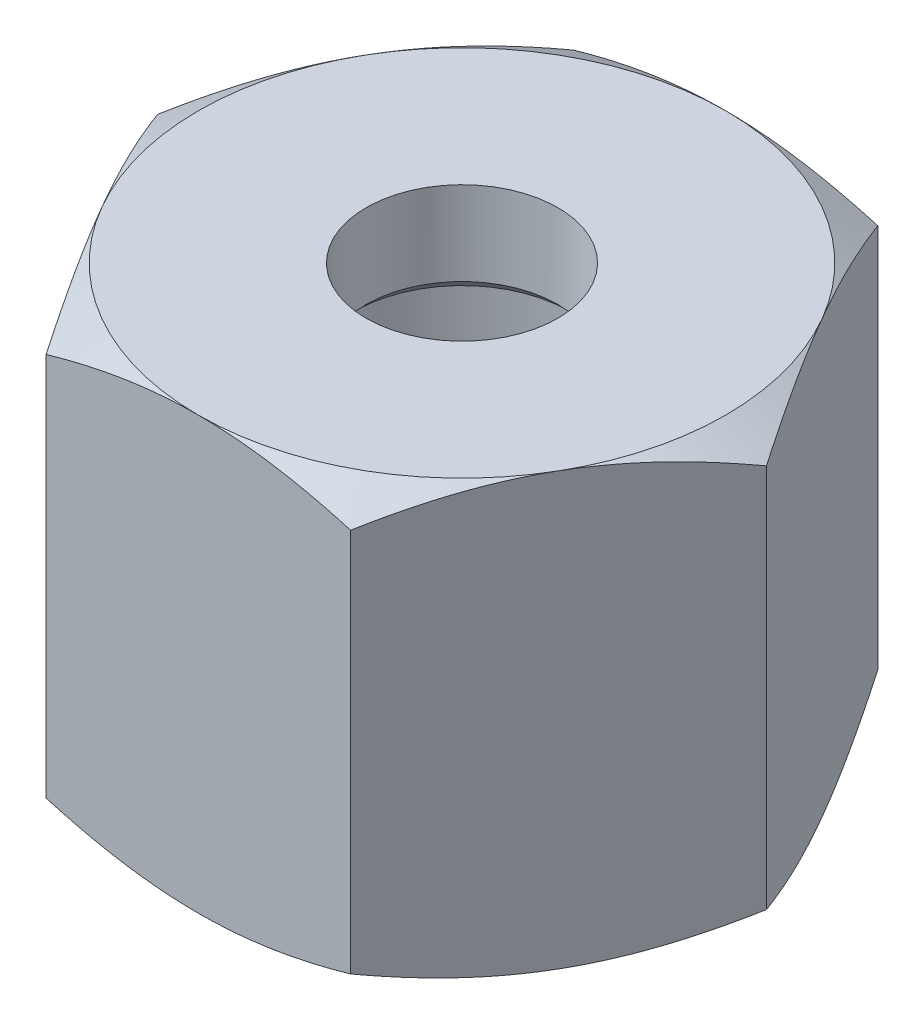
ISO-10303-21;
HEADER;
FILE_DESCRIPTION(('STEP AP214'),'2;1');
FILE_NAME('part.step','',(''),(''),'','','');
FILE_SCHEMA(('AUTOMOTIVE_DESIGN { 1 0 10303 214 1 1 1 1 }'));
ENDSEC;
DATA;
#1=APPLICATION_CONTEXT('core data for automotive mechanical design processes');
#2=APPLICATION_PROTOCOL_DEFINITION('international standard','automotive_design',2000,#1);
#3=PRODUCT_CONTEXT('',#1,'mechanical');
#4=PRODUCT('Part','Part','',(#3));
#5=PRODUCT_RELATED_PRODUCT_CATEGORY('part','',(#4));
#6=PRODUCT_DEFINITION_FORMATION('','',#4);
#7=PRODUCT_DEFINITION_CONTEXT('part definition',#1,'design');
#8=PRODUCT_DEFINITION('design','',#6,#7);
#9=PRODUCT_DEFINITION_SHAPE('','',#8);
#10=(LENGTH_UNIT() NAMED_UNIT(*) SI_UNIT(.MILLI.,.METRE.));
#11=(NAMED_UNIT(*) PLANE_ANGLE_UNIT() SI_UNIT($,.RADIAN.));
#12=(NAMED_UNIT(*) SI_UNIT($,.STERADIAN.) SOLID_ANGLE_UNIT());
#13=UNCERTAINTY_MEASURE_WITH_UNIT(LENGTH_MEASURE(1.E-05),#10,'distance_accuracy_value','');
#14=(GEOMETRIC_REPRESENTATION_CONTEXT(3) GLOBAL_UNCERTAINTY_ASSIGNED_CONTEXT((#13)) GLOBAL_UNIT_ASSIGNED_CONTEXT((#10,
#11,#12)) REPRESENTATION_CONTEXT('',''));
#15=CARTESIAN_POINT('',(0.,0.,0.));
#16=DIRECTION('',(0.,0.,1.));
#17=DIRECTION('',(1.,0.,0.));
#18=AXIS2_PLACEMENT_3D('',#15,#16,#17);
#19=CARTESIAN_POINT('',(6.35085296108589,18.,11.));
#20=DIRECTION('',(-0.866025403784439,0.,-0.5));
#21=DIRECTION('',(-0.5,0.,0.866025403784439));
#22=AXIS2_PLACEMENT_3D('',#19,#20,#21);
#23=PLANE('',#22);
#24=CARTESIAN_POINT('',(12.7018213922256,0.982547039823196,-0.000200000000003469));
#25=CARTESIAN_POINT('',(12.5622159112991,0.901959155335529,0.241603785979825));
#26=CARTESIAN_POINT('',(12.4220899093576,0.825028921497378,0.48430914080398));
#27=CARTESIAN_POINT('',(12.1407142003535,0.67949864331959,0.971666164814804));
#28=CARTESIAN_POINT('',(11.999464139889,0.610901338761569,1.21631844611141));
#29=CARTESIAN_POINT('',(11.5734380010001,0.418936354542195,1.9542173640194));
#30=CARTESIAN_POINT('',(11.2869801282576,0.309747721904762,2.45037695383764));
#31=CARTESIAN_POINT('',(10.8583090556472,0.181714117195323,3.19285703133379));
#32=CARTESIAN_POINT('',(10.7173765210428,0.145242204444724,3.43695934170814));
#33=CARTESIAN_POINT('',(10.4348589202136,0.0840813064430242,3.92629418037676));
#34=CARTESIAN_POINT('',(10.2932738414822,0.0593925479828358,4.17152673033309));
#35=CARTESIAN_POINT('',(10.0098676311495,0.0224303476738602,4.66240068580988));
#36=CARTESIAN_POINT('',(9.86804698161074,0.0101421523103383,4.90804125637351));
#37=CARTESIAN_POINT('',(9.58427426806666,-0.00175707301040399,5.39955001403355));
#38=CARTESIAN_POINT('',(9.44232220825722,-0.00136849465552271,5.64541819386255));
#39=CARTESIAN_POINT('',(9.17694200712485,0.0112011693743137,6.10507018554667));
#40=CARTESIAN_POINT('',(9.05349494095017,0.0218490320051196,6.31888677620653));
#41=CARTESIAN_POINT('',(8.80688473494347,0.0525316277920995,6.74602818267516));
#42=CARTESIAN_POINT('',(8.68372161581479,0.0725670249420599,6.9593529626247));
#43=CARTESIAN_POINT('',(8.43774623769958,0.12167538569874,7.38539481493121));
#44=CARTESIAN_POINT('',(8.31493435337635,0.150755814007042,7.59811123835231));
#45=CARTESIAN_POINT('',(8.0698863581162,0.217443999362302,8.02254681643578));
#46=CARTESIAN_POINT('',(7.94765028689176,0.255052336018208,8.23426590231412));
#47=CARTESIAN_POINT('',(7.5765957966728,0.38161991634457,8.87695113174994));
#48=CARTESIAN_POINT('',(7.32885191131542,0.483199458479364,9.30605612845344));
#49=CARTESIAN_POINT('',(6.83705838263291,0.713743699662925,10.1578675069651));
#50=CARTESIAN_POINT('',(6.59300244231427,0.842654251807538,10.580584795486));
#51=CARTESIAN_POINT('',(6.35073749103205,0.982547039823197,11.0002));
#52=B_SPLINE_CURVE_WITH_KNOTS('',3,(#24,#25,#26,#27,#28,#29,#30,#31,#32,#33,#34,#35,#36,#37,#38,
#39,#40,#41,#42,#43,#44,#45,#46,#47,#48,#49,#50,#51),.UNSPECIFIED.,.F.,.F.,(4,2,2,2,2,2,2,2,2,2,
2,2,2,4),(0.,0.871755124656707,1.74379610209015,3.49159027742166,4.34403665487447,
5.19649943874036,6.0479468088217,6.89936787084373,7.64056020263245,8.38180496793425,
9.12366309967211,9.86557166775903,11.3820155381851,12.8954827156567),.UNSPECIFIED.);
#53=CARTESIAN_POINT('',(12.7017059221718,0.982480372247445,0.));
#54=VERTEX_POINT('',#53);
#55=CARTESIAN_POINT('',(9.52627944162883,0.,5.5));
#56=VERTEX_POINT('',#55);
#57=EDGE_CURVE('E53',#54,#56,#52,.T.);
#58=ORIENTED_EDGE('',*,*,#57,.F.);
#59=DIRECTION('',(0.,-1.,0.));
#60=VECTOR('',#59,1.);
#61=CARTESIAN_POINT('',(12.7017059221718,18.,0.));
#62=LINE('',#61,#60);
#63=CARTESIAN_POINT('',(12.7017059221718,17.0175196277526,0.));
#64=VERTEX_POINT('',#63);
#65=EDGE_CURVE('E172',#64,#54,#62,.T.);
#66=ORIENTED_EDGE('',*,*,#65,.F.);
#67=CARTESIAN_POINT('',(6.35073749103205,17.0174529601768,11.0002));
#68=CARTESIAN_POINT('',(6.49034297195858,17.0980408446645,10.7583962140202));
#69=CARTESIAN_POINT('',(6.63046897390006,17.1749710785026,10.515690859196));
#70=CARTESIAN_POINT('',(6.91184468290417,17.3205013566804,10.0283338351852));
#71=CARTESIAN_POINT('',(7.05309474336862,17.3890986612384,9.78368155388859));
#72=CARTESIAN_POINT('',(7.47912088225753,17.5810636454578,9.04578263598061));
#73=CARTESIAN_POINT('',(7.76557875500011,17.6902522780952,8.54962304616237));
#74=CARTESIAN_POINT('',(8.19424982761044,17.8182858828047,7.80714296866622));
#75=CARTESIAN_POINT('',(8.33518236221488,17.8547577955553,7.56304065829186));
#76=CARTESIAN_POINT('',(8.61769996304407,17.915918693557,7.07370581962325));
#77=CARTESIAN_POINT('',(8.75928504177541,17.9406074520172,6.82847326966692));
#78=CARTESIAN_POINT('',(9.04269125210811,17.9775696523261,6.33759931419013));
#79=CARTESIAN_POINT('',(9.18451190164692,17.9898578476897,6.0919587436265));
#80=CARTESIAN_POINT('',(9.468284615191,18.0017570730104,5.60044998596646));
#81=CARTESIAN_POINT('',(9.61023667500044,18.0013684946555,5.35458180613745));
#82=CARTESIAN_POINT('',(9.87561687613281,17.9887988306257,4.89492981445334));
#83=CARTESIAN_POINT('',(9.99906394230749,17.9781509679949,4.68111322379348));
#84=CARTESIAN_POINT('',(10.2456741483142,17.9474683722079,4.25397181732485));
#85=CARTESIAN_POINT('',(10.3688372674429,17.9274329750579,4.04064703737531));
#86=CARTESIAN_POINT('',(10.6148126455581,17.8783246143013,3.6146051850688));
#87=CARTESIAN_POINT('',(10.7376245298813,17.849244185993,3.4018887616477));
#88=CARTESIAN_POINT('',(10.9826725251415,17.7825560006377,2.97745318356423));
#89=CARTESIAN_POINT('',(11.1049085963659,17.7449476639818,2.76573409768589));
#90=CARTESIAN_POINT('',(11.4759630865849,17.6183800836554,2.12304886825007));
#91=CARTESIAN_POINT('',(11.7237069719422,17.5168005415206,1.69394387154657));
#92=CARTESIAN_POINT('',(12.2155005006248,17.2862563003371,0.842132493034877));
#93=CARTESIAN_POINT('',(12.4595564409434,17.1573457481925,0.419415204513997));
#94=CARTESIAN_POINT('',(12.7018213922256,17.0174529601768,-0.000200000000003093));
#95=B_SPLINE_CURVE_WITH_KNOTS('',3,(#67,#68,#69,#70,#71,#72,#73,#74,#75,#76,#77,#78,#79,#80,#81,
#82,#83,#84,#85,#86,#87,#88,#89,#90,#91,#92,#93,#94),.UNSPECIFIED.,.F.,.F.,(4,2,2,2,2,2,2,2,2,2,
2,2,2,4),(0.,0.871755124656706,1.74379610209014,3.49159027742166,4.34403665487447,
5.19649943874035,6.0479468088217,6.89936787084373,7.64056020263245,8.38180496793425,
9.12366309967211,9.86557166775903,11.3820155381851,12.8954827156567),.UNSPECIFIED.);
#96=CARTESIAN_POINT('',(9.52627944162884,18.,5.5));
#97=VERTEX_POINT('',#96);
#98=EDGE_CURVE('E217',#97,#64,#95,.T.);
#99=ORIENTED_EDGE('',*,*,#98,.F.);
#100=CARTESIAN_POINT('',(6.35085296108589,17.0175196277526,11.));
#101=VERTEX_POINT('',#100);
#102=EDGE_CURVE('E163',#101,#97,#95,.T.);
#103=ORIENTED_EDGE('',*,*,#102,.F.);
#104=DIRECTION('',(0.,-1.,0.));
#105=VECTOR('',#104,1.);
#106=CARTESIAN_POINT('',(6.35085296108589,18.,11.));
#107=LINE('',#106,#105);
#108=CARTESIAN_POINT('',(6.35085296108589,0.982480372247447,11.));
#109=VERTEX_POINT('',#108);
#110=EDGE_CURVE('E158',#101,#109,#107,.T.);
#111=ORIENTED_EDGE('',*,*,#110,.T.);
#112=EDGE_CURVE('E150',#56,#109,#52,.T.);
#113=ORIENTED_EDGE('',*,*,#112,.F.);
#114=EDGE_LOOP('',(#58,#66,#99,#103,#111,#113));
#115=FACE_BOUND('',#114,.T.);
#116=ADVANCED_FACE('F38',(#115),#23,.F.);
#117=CARTESIAN_POINT('',(12.7017059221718,18.,0.));
#118=DIRECTION('',(-0.866025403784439,0.,0.5));
#119=DIRECTION('',(0.5,0.,0.866025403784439));
#120=AXIS2_PLACEMENT_3D('',#117,#118,#119);
#121=PLANE('',#120);
#122=CARTESIAN_POINT('',(6.35073749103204,0.982547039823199,-11.0002));
#123=CARTESIAN_POINT('',(6.49034297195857,0.901959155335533,-10.7583962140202));
#124=CARTESIAN_POINT('',(6.63046897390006,0.825028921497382,-10.515690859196));
#125=CARTESIAN_POINT('',(6.91184468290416,0.679498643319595,-10.0283338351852));
#126=CARTESIAN_POINT('',(7.05309474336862,0.610901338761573,-9.7836815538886));
#127=CARTESIAN_POINT('',(7.47912088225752,0.418936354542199,-9.04578263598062));
#128=CARTESIAN_POINT('',(7.7655787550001,0.309747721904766,-8.54962304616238));
#129=CARTESIAN_POINT('',(8.19424982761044,0.181714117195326,-7.80714296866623));
#130=CARTESIAN_POINT('',(8.33518236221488,0.145242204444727,-7.56304065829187));
#131=CARTESIAN_POINT('',(8.61769996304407,0.0840813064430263,-7.07370581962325));
#132=CARTESIAN_POINT('',(8.75928504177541,0.0593925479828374,-6.82847326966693));
#133=CARTESIAN_POINT('',(9.04269125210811,0.0224303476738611,-6.33759931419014));
#134=CARTESIAN_POINT('',(9.18451190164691,0.0101421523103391,-6.09195874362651));
#135=CARTESIAN_POINT('',(9.468284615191,-0.00175707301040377,-5.60044998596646));
#136=CARTESIAN_POINT('',(9.61023667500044,-0.00136849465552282,-5.35458180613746));
#137=CARTESIAN_POINT('',(9.87561687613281,0.0112011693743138,-4.89492981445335));
#138=CARTESIAN_POINT('',(9.99906394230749,0.0218490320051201,-4.68111322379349));
#139=CARTESIAN_POINT('',(10.2456741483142,0.0525316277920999,-4.25397181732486));
#140=CARTESIAN_POINT('',(10.3688372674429,0.0725670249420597,-4.04064703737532));
#141=CARTESIAN_POINT('',(10.6148126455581,0.121675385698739,-3.61460518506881));
#142=CARTESIAN_POINT('',(10.7376245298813,0.150755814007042,-3.40188876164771));
#143=CARTESIAN_POINT('',(10.9826725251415,0.217443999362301,-2.97745318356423));
#144=CARTESIAN_POINT('',(11.1049085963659,0.255052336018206,-2.7657340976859));
#145=CARTESIAN_POINT('',(11.4759630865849,0.381619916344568,-2.12304886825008));
#146=CARTESIAN_POINT('',(11.7237069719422,0.483199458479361,-1.69394387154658));
#147=CARTESIAN_POINT('',(12.2155005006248,0.713743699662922,-0.842132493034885));
#148=CARTESIAN_POINT('',(12.4595564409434,0.842654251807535,-0.419415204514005));
#149=CARTESIAN_POINT('',(12.7018213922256,0.982547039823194,0.000199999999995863));
#150=B_SPLINE_CURVE_WITH_KNOTS('',3,(#122,#123,#124,#125,#126,#127,#128,#129,#130,#131,#132,
#133,#134,#135,#136,#137,#138,#139,#140,#141,#142,#143,#144,#145,#146,#147,#148,#149),
.UNSPECIFIED.,.F.,.F.,(4,2,2,2,2,2,2,2,2,2,2,2,2,4),(0.,0.871755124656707,1.74379610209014,
3.49159027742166,4.34403665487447,5.19649943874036,6.0479468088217,6.89936787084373,
7.64056020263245,8.38180496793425,9.12366309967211,9.86557166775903,11.3820155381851,
12.8954827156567),.UNSPECIFIED.);
#151=CARTESIAN_POINT('',(6.35085296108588,0.982480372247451,-11.));
#152=VERTEX_POINT('',#151);
#153=CARTESIAN_POINT('',(9.52627944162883,0.,-5.5));
#154=VERTEX_POINT('',#153);
#155=EDGE_CURVE('E61',#152,#154,#150,.T.);
#156=ORIENTED_EDGE('',*,*,#155,.F.);
#157=DIRECTION('',(0.,-1.,0.));
#158=VECTOR('',#157,1.);
#159=CARTESIAN_POINT('',(6.35085296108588,18.,-11.));
#160=LINE('',#159,#158);
#161=CARTESIAN_POINT('',(6.35085296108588,17.0175196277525,-11.));
#162=VERTEX_POINT('',#161);
#163=EDGE_CURVE('E169',#162,#152,#160,.T.);
#164=ORIENTED_EDGE('',*,*,#163,.F.);
#165=CARTESIAN_POINT('',(12.7018213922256,17.0174529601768,0.000199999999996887));
#166=CARTESIAN_POINT('',(12.5622159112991,17.0980408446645,-0.241603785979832));
#167=CARTESIAN_POINT('',(12.4220899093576,17.1749710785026,-0.484309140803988));
#168=CARTESIAN_POINT('',(12.1407142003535,17.3205013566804,-0.971666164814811));
#169=CARTESIAN_POINT('',(11.999464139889,17.3890986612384,-1.21631844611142));
#170=CARTESIAN_POINT('',(11.5734380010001,17.5810636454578,-1.9542173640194));
#171=CARTESIAN_POINT('',(11.2869801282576,17.6902522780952,-2.45037695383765));
#172=CARTESIAN_POINT('',(10.8583090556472,17.8182858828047,-3.1928570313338));
#173=CARTESIAN_POINT('',(10.7173765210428,17.8547577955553,-3.43695934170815));
#174=CARTESIAN_POINT('',(10.4348589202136,17.915918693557,-3.92629418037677));
#175=CARTESIAN_POINT('',(10.2932738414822,17.9406074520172,-4.17152673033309));
#176=CARTESIAN_POINT('',(10.0098676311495,17.9775696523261,-4.66240068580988));
#177=CARTESIAN_POINT('',(9.86804698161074,17.9898578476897,-4.90804125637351));
#178=CARTESIAN_POINT('',(9.58427426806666,18.0017570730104,-5.39955001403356));
#179=CARTESIAN_POINT('',(9.44232220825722,18.0013684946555,-5.64541819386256));
#180=CARTESIAN_POINT('',(9.17694200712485,17.9887988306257,-6.10507018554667));
#181=CARTESIAN_POINT('',(9.05349494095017,17.9781509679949,-6.31888677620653));
#182=CARTESIAN_POINT('',(8.80688473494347,17.9474683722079,-6.74602818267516));
#183=CARTESIAN_POINT('',(8.68372161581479,17.9274329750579,-6.9593529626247));
#184=CARTESIAN_POINT('',(8.43774623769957,17.8783246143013,-7.38539481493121));
#185=CARTESIAN_POINT('',(8.31493435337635,17.849244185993,-7.59811123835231));
#186=CARTESIAN_POINT('',(8.0698863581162,17.7825560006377,-8.02254681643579));
#187=CARTESIAN_POINT('',(7.94765028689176,17.7449476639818,-8.23426590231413));
#188=CARTESIAN_POINT('',(7.57659579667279,17.6183800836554,-8.87695113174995));
#189=CARTESIAN_POINT('',(7.32885191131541,17.5168005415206,-9.30605612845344));
#190=CARTESIAN_POINT('',(6.8370583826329,17.2862563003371,-10.1578675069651));
#191=CARTESIAN_POINT('',(6.59300244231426,17.1573457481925,-10.580584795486));
#192=CARTESIAN_POINT('',(6.35073749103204,17.0174529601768,-11.0002));
#193=B_SPLINE_CURVE_WITH_KNOTS('',3,(#165,#166,#167,#168,#169,#170,#171,#172,#173,#174,#175,
#176,#177,#178,#179,#180,#181,#182,#183,#184,#185,#186,#187,#188,#189,#190,#191,#192),
.UNSPECIFIED.,.F.,.F.,(4,2,2,2,2,2,2,2,2,2,2,2,2,4),(0.,0.871755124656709,1.74379610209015,
3.49159027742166,4.34403665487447,5.19649943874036,6.0479468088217,6.89936787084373,
7.64056020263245,8.38180496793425,9.12366309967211,9.86557166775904,11.3820155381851,
12.8954827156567),.UNSPECIFIED.);
#194=CARTESIAN_POINT('',(9.52627944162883,18.,-5.50000000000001));
#195=VERTEX_POINT('',#194);
#196=EDGE_CURVE('E294',#195,#162,#193,.T.);
#197=ORIENTED_EDGE('',*,*,#196,.F.);
#198=EDGE_CURVE('E298',#64,#195,#193,.T.);
#199=ORIENTED_EDGE('',*,*,#198,.F.);
#200=ORIENTED_EDGE('',*,*,#65,.T.);
#201=EDGE_CURVE('E262',#154,#54,#150,.T.);
#202=ORIENTED_EDGE('',*,*,#201,.F.);
#203=EDGE_LOOP('',(#156,#164,#197,#199,#200,#202));
#204=FACE_BOUND('',#203,.T.);
#205=ADVANCED_FACE('F204',(#204),#121,.F.);
#206=CARTESIAN_POINT('',(6.35085296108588,18.,-11.));
#207=DIRECTION('',(0.,0.,1.));
#208=DIRECTION('',(1.,0.,0.));
#209=AXIS2_PLACEMENT_3D('',#206,#207,#208);
#210=PLANE('',#209);
#211=CARTESIAN_POINT('',(-16.8458280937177,5.26496849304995,-11.));
#212=CARTESIAN_POINT('',(-16.60434649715,5.14823483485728,-11.));
#213=CARTESIAN_POINT('',(-16.3625730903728,5.03210512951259,-11.));
#214=CARTESIAN_POINT('',(-15.8783810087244,4.80119224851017,-11.));
#215=CARTESIAN_POINT('',(-15.6359623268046,4.68640908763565,-11.));
#216=CARTESIAN_POINT('',(-14.9075749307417,4.34425411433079,-11.));
#217=CARTESIAN_POINT('',(-14.4205533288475,4.119114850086,-11.));
#218=CARTESIAN_POINT('',(-13.4403598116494,3.67495503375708,-11.));
#219=CARTESIAN_POINT('',(-12.9471686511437,3.4559768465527,-11.));
#220=CARTESIAN_POINT('',(-11.9567341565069,3.02741887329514,-11.));
#221=CARTESIAN_POINT('',(-11.459491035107,2.81783859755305,-11.));
#222=CARTESIAN_POINT('',(-10.4539778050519,2.40808867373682,-11.));
#223=CARTESIAN_POINT('',(-9.94564729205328,2.208066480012,-11.));
#224=CARTESIAN_POINT('',(-8.92298777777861,1.82368101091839,-11.));
#225=CARTESIAN_POINT('',(-8.40865811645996,1.63931947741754,-11.));
#226=CARTESIAN_POINT('',(-7.37425454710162,1.29120979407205,-11.));
#227=CARTESIAN_POINT('',(-6.85419550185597,1.12741784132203,-11.));
#228=CARTESIAN_POINT('',(-5.80663388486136,0.825757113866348,-11.));
#229=CARTESIAN_POINT('',(-5.27913372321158,0.687880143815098,-11.));
#230=CARTESIAN_POINT('',(-4.48220250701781,0.505547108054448,-11.));
#231=CARTESIAN_POINT('',(-4.21555592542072,0.448840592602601,-11.));
#232=CARTESIAN_POINT('',(-3.68048740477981,0.34448343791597,-11.));
#233=CARTESIAN_POINT('',(-3.41206550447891,0.296832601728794,-11.));
#234=CARTESIAN_POINT('',(-2.87362104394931,0.211430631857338,-11.));
#235=CARTESIAN_POINT('',(-2.60359835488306,0.173680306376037,-11.));
#236=CARTESIAN_POINT('',(-2.06227809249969,0.108840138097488,-11.));
#237=CARTESIAN_POINT('',(-1.7909805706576,0.0817498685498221,-11.));
#238=CARTESIAN_POINT('',(-1.24921360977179,0.0389565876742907,-11.));
#239=CARTESIAN_POINT('',(-0.978749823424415,0.0231824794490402,-11.));
#240=CARTESIAN_POINT('',(-0.43739753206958,0.00310533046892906,-11.));
#241=CARTESIAN_POINT('',(-0.166509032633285,-0.00119785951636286,-11.));
#242=CARTESIAN_POINT('',(0.375129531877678,0.00176893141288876,-11.));
#243=CARTESIAN_POINT('',(0.645879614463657,0.00903566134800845,-11.));
#244=CARTESIAN_POINT('',(1.18683741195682,0.0349616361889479,-11.));
#245=CARTESIAN_POINT('',(1.45704509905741,0.0536214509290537,-11.));
#246=CARTESIAN_POINT('',(2.11186732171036,0.112257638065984,-11.));
#247=CARTESIAN_POINT('',(2.49597946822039,0.157937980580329,-11.));
#248=CARTESIAN_POINT('',(3.2612619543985,0.269786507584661,-11.));
#249=CARTESIAN_POINT('',(3.64243146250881,0.33596028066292,-11.));
#250=CARTESIAN_POINT('',(4.40151370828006,0.48644872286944,-11.));
#251=CARTESIAN_POINT('',(4.77942301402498,0.570780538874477,-11.));
#252=CARTESIAN_POINT('',(5.53135425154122,0.755011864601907,-11.));
#253=CARTESIAN_POINT('',(5.90537654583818,0.854909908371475,-11.));
#254=CARTESIAN_POINT('',(6.65874919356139,1.0704958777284,-11.));
#255=CARTESIAN_POINT('',(7.03800528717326,1.18651093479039,-11.));
#256=CARTESIAN_POINT('',(7.7925087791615,1.430009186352,-11.));
#257=CARTESIAN_POINT('',(8.16775874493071,1.55748447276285,-11.));
#258=CARTESIAN_POINT('',(8.91274428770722,1.82126962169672,-11.));
#259=CARTESIAN_POINT('',(9.28249901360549,1.95752572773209,-11.));
#260=CARTESIAN_POINT('',(10.0191392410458,2.23803873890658,-11.));
#261=CARTESIAN_POINT('',(10.3860235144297,2.3822988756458,-11.));
#262=CARTESIAN_POINT('',(10.7515747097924,2.52976936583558,-11.));
#263=B_SPLINE_CURVE_WITH_KNOTS('',3,(#211,#212,#213,#214,#215,#216,#217,#218,#219,#220,#221,
#222,#223,#224,#225,#226,#227,#228,#229,#230,#231,#232,#233,#234,#235,#236,#237,#238,#239,#240,
#241,#242,#243,#244,#245,#246,#247,#248,#249,#250,#251,#252,#253,#254,#255,#256,#257,#258,#259,
#260,#261,#262),.UNSPECIFIED.,.F.,.F.,(4,2,2,2,2,2,2,2,2,2,2,2,2,2,2,2,2,2,2,2,2,2,2,2,2,4),(0.,
0.804648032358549,1.60930489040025,3.21888018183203,4.83766217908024,6.45635972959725,
8.09496684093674,9.73375596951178,11.368993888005,13.0037138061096,13.8214137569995,
14.6390959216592,15.4568448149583,16.274560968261,17.0870934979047,17.8996154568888,
18.7119091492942,19.5242434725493,20.6840538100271,21.8441807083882,23.0054079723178,
24.1665259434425,25.3561172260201,26.5448938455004,27.7269802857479,28.9095475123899),.UNSPECIFIED.);
#264=CARTESIAN_POINT('',(-6.35085296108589,0.982480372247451,-11.));
#265=VERTEX_POINT('',#264);
#266=CARTESIAN_POINT('',(0.,0.,-11.));
#267=VERTEX_POINT('',#266);
#268=EDGE_CURVE('E271',#265,#267,#263,.T.);
#269=ORIENTED_EDGE('',*,*,#268,.F.);
#270=DIRECTION('',(0.,-1.,0.));
#271=VECTOR('',#270,1.);
#272=CARTESIAN_POINT('',(-6.35085296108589,18.,-11.));
#273=LINE('',#272,#271);
#274=CARTESIAN_POINT('',(-6.35085296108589,17.0175196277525,-11.));
#275=VERTEX_POINT('',#274);
#276=EDGE_CURVE('E160',#275,#265,#273,.T.);
#277=ORIENTED_EDGE('',*,*,#276,.F.);
#278=CARTESIAN_POINT('',(-16.8458280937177,12.7350315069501,-11.));
#279=CARTESIAN_POINT('',(-16.60434649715,12.8517651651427,-11.));
#280=CARTESIAN_POINT('',(-16.3625730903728,12.9678948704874,-11.));
#281=CARTESIAN_POINT('',(-15.8783810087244,13.1988077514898,-11.));
#282=CARTESIAN_POINT('',(-15.6359623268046,13.3135909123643,-11.));
#283=CARTESIAN_POINT('',(-14.9075749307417,13.6557458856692,-11.));
#284=CARTESIAN_POINT('',(-14.4205533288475,13.880885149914,-11.));
#285=CARTESIAN_POINT('',(-13.4403598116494,14.3250449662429,-11.));
#286=CARTESIAN_POINT('',(-12.9471686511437,14.5440231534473,-11.));
#287=CARTESIAN_POINT('',(-11.9567341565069,14.9725811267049,-11.));
#288=CARTESIAN_POINT('',(-11.459491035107,15.182161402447,-11.));
#289=CARTESIAN_POINT('',(-10.4539778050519,15.5919113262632,-11.));
#290=CARTESIAN_POINT('',(-9.94564729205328,15.791933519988,-11.));
#291=CARTESIAN_POINT('',(-8.92298777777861,16.1763189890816,-11.));
#292=CARTESIAN_POINT('',(-8.40865811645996,16.3606805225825,-11.));
#293=CARTESIAN_POINT('',(-7.37425454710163,16.708790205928,-11.));
#294=CARTESIAN_POINT('',(-6.85419550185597,16.872582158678,-11.));
#295=CARTESIAN_POINT('',(-5.80663388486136,17.1742428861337,-11.));
#296=CARTESIAN_POINT('',(-5.27913372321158,17.3121198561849,-11.));
#297=CARTESIAN_POINT('',(-4.48220250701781,17.4944528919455,-11.));
#298=CARTESIAN_POINT('',(-4.21555592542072,17.5511594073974,-11.));
#299=CARTESIAN_POINT('',(-3.68048740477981,17.655516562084,-11.));
#300=CARTESIAN_POINT('',(-3.41206550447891,17.7031673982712,-11.));
#301=CARTESIAN_POINT('',(-2.87362104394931,17.7885693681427,-11.));
#302=CARTESIAN_POINT('',(-2.60359835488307,17.826319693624,-11.));
#303=CARTESIAN_POINT('',(-2.06227809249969,17.8911598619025,-11.));
#304=CARTESIAN_POINT('',(-1.7909805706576,17.9182501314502,-11.));
#305=CARTESIAN_POINT('',(-1.24921360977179,17.9610434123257,-11.));
#306=CARTESIAN_POINT('',(-0.978749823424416,17.976817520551,-11.));
#307=CARTESIAN_POINT('',(-0.437397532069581,17.9968946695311,-11.));
#308=CARTESIAN_POINT('',(-0.166509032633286,18.0011978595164,-11.));
#309=CARTESIAN_POINT('',(0.375129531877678,17.9982310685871,-11.));
#310=CARTESIAN_POINT('',(0.645879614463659,17.990964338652,-11.));
#311=CARTESIAN_POINT('',(1.18683741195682,17.9650383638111,-11.));
#312=CARTESIAN_POINT('',(1.45704509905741,17.9463785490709,-11.));
#313=CARTESIAN_POINT('',(2.11186732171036,17.887742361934,-11.));
#314=CARTESIAN_POINT('',(2.49597946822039,17.8420620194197,-11.));
#315=CARTESIAN_POINT('',(3.26126195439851,17.7302134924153,-11.));
#316=CARTESIAN_POINT('',(3.64243146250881,17.6640397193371,-11.));
#317=CARTESIAN_POINT('',(4.40151370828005,17.5135512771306,-11.));
#318=CARTESIAN_POINT('',(4.77942301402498,17.4292194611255,-11.));
#319=CARTESIAN_POINT('',(5.53135425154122,17.2449881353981,-11.));
#320=CARTESIAN_POINT('',(5.90537654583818,17.1450900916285,-11.));
#321=CARTESIAN_POINT('',(6.65874919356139,16.9295041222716,-11.));
#322=CARTESIAN_POINT('',(7.03800528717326,16.8134890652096,-11.));
#323=CARTESIAN_POINT('',(7.7925087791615,16.569990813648,-11.));
#324=CARTESIAN_POINT('',(8.1677587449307,16.4425155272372,-11.));
#325=CARTESIAN_POINT('',(8.91274428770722,16.1787303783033,-11.));
#326=CARTESIAN_POINT('',(9.28249901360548,16.0424742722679,-11.));
#327=CARTESIAN_POINT('',(10.0191392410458,15.7619612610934,-11.));
#328=CARTESIAN_POINT('',(10.3860235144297,15.6177011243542,-11.));
#329=CARTESIAN_POINT('',(10.7515747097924,15.4702306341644,-11.));
#330=B_SPLINE_CURVE_WITH_KNOTS('',3,(#278,#279,#280,#281,#282,#283,#284,#285,#286,#287,#288,
#289,#290,#291,#292,#293,#294,#295,#296,#297,#298,#299,#300,#301,#302,#303,#304,#305,#306,#307,
#308,#309,#310,#311,#312,#313,#314,#315,#316,#317,#318,#319,#320,#321,#322,#323,#324,#325,#326,
#327,#328,#329),.UNSPECIFIED.,.F.,.F.,(4,2,2,2,2,2,2,2,2,2,2,2,2,2,2,2,2,2,2,2,2,2,2,2,2,4),(0.,
0.804648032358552,1.60930489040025,3.21888018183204,4.83766217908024,6.45635972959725,
8.09496684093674,9.73375596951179,11.368993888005,13.0037138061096,13.8214137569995,
14.6390959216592,15.4568448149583,16.2745609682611,17.0870934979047,17.8996154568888,
18.7119091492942,19.5242434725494,20.6840538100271,21.8441807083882,23.0054079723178,
24.1665259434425,25.3561172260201,26.5448938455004,27.726980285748,28.9095475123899),.UNSPECIFIED.);
#331=CARTESIAN_POINT('',(0.,18.,-11.));
#332=VERTEX_POINT('',#331);
#333=EDGE_CURVE('E282',#332,#275,#330,.F.);
#334=ORIENTED_EDGE('',*,*,#333,.F.);
#335=EDGE_CURVE('E287',#162,#332,#330,.F.);
#336=ORIENTED_EDGE('',*,*,#335,.F.);
#337=ORIENTED_EDGE('',*,*,#163,.T.);
#338=EDGE_CURVE('E266',#267,#152,#263,.T.);
#339=ORIENTED_EDGE('',*,*,#338,.F.);
#340=EDGE_LOOP('',(#269,#277,#334,#336,#337,#339));
#341=FACE_BOUND('',#340,.T.);
#342=ADVANCED_FACE('F210',(#341),#210,.F.);
#343=CARTESIAN_POINT('',(-6.35085296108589,18.,-11.));
#344=DIRECTION('',(0.866025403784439,0.,0.5));
#345=DIRECTION('',(0.5,0.,-0.866025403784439));
#346=AXIS2_PLACEMENT_3D('',#343,#344,#345);
#347=PLANE('',#346);
#348=CARTESIAN_POINT('',(-12.7018213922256,0.982547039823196,0.000200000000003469));
#349=CARTESIAN_POINT('',(-12.5622159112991,0.90195915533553,-0.241603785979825));
#350=CARTESIAN_POINT('',(-12.4220899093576,0.825028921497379,-0.48430914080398));
#351=CARTESIAN_POINT('',(-12.1407142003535,0.679498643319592,-0.971666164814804));
#352=CARTESIAN_POINT('',(-11.999464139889,0.610901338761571,-1.21631844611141));
#353=CARTESIAN_POINT('',(-11.5734380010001,0.418936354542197,-1.9542173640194));
#354=CARTESIAN_POINT('',(-11.2869801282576,0.309747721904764,-2.45037695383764));
#355=CARTESIAN_POINT('',(-10.8583090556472,0.181714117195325,-3.19285703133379));
#356=CARTESIAN_POINT('',(-10.7173765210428,0.145242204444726,-3.43695934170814));
#357=CARTESIAN_POINT('',(-10.4348589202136,0.0840813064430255,-3.92629418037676));
#358=CARTESIAN_POINT('',(-10.2932738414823,0.0593925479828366,-4.17152673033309));
#359=CARTESIAN_POINT('',(-10.0098676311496,0.0224303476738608,-4.66240068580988));
#360=CARTESIAN_POINT('',(-9.86804698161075,0.0101421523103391,-4.90804125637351));
#361=CARTESIAN_POINT('',(-9.58427426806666,-0.00175707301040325,-5.39955001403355));
#362=CARTESIAN_POINT('',(-9.44232220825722,-0.00136849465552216,-5.64541819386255));
#363=CARTESIAN_POINT('',(-9.17694200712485,0.0112011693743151,-6.10507018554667));
#364=CARTESIAN_POINT('',(-9.05349494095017,0.0218490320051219,-6.31888677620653));
#365=CARTESIAN_POINT('',(-8.80688473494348,0.0525316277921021,-6.74602818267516));
#366=CARTESIAN_POINT('',(-8.68372161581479,0.072567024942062,-6.95935296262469));
#367=CARTESIAN_POINT('',(-8.43774623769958,0.121675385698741,-7.38539481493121));
#368=CARTESIAN_POINT('',(-8.31493435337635,0.150755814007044,-7.59811123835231));
#369=CARTESIAN_POINT('',(-8.06988635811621,0.217443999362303,-8.02254681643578));
#370=CARTESIAN_POINT('',(-7.94765028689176,0.255052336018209,-8.23426590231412));
#371=CARTESIAN_POINT('',(-7.5765957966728,0.381619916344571,-8.87695113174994));
#372=CARTESIAN_POINT('',(-7.32885191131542,0.483199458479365,-9.30605612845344));
#373=CARTESIAN_POINT('',(-6.83705838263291,0.713743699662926,-10.1578675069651));
#374=CARTESIAN_POINT('',(-6.59300244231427,0.84265425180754,-10.580584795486));
#375=CARTESIAN_POINT('',(-6.35073749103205,0.982547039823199,-11.0002));
#376=B_SPLINE_CURVE_WITH_KNOTS('',3,(#348,#349,#350,#351,#352,#353,#354,#355,#356,#357,#358,
#359,#360,#361,#362,#363,#364,#365,#366,#367,#368,#369,#370,#371,#372,#373,#374,#375),
.UNSPECIFIED.,.F.,.F.,(4,2,2,2,2,2,2,2,2,2,2,2,2,4),(0.,0.871755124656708,1.74379610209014,
3.49159027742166,4.34403665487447,5.19649943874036,6.0479468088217,6.89936787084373,
7.64056020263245,8.38180496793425,9.12366309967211,9.86557166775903,11.3820155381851,
12.8954827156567),.UNSPECIFIED.);
#377=CARTESIAN_POINT('',(-12.7017059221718,0.982480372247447,0.));
#378=VERTEX_POINT('',#377);
#379=CARTESIAN_POINT('',(-9.52627944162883,0.,-5.5));
#380=VERTEX_POINT('',#379);
#381=EDGE_CURVE('E233',#378,#380,#376,.T.);
#382=ORIENTED_EDGE('',*,*,#381,.F.);
#383=DIRECTION('',(0.,-1.,0.));
#384=VECTOR('',#383,1.);
#385=CARTESIAN_POINT('',(-12.7017059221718,18.,0.));
#386=LINE('',#385,#384);
#387=CARTESIAN_POINT('',(-12.7017059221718,17.0175196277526,0.));
#388=VERTEX_POINT('',#387);
#389=EDGE_CURVE('E157',#388,#378,#386,.T.);
#390=ORIENTED_EDGE('',*,*,#389,.F.);
#391=CARTESIAN_POINT('',(-6.35073749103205,17.0174529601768,-11.0002));
#392=CARTESIAN_POINT('',(-6.49034297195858,17.0980408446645,-10.7583962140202));
#393=CARTESIAN_POINT('',(-6.63046897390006,17.1749710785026,-10.515690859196));
#394=CARTESIAN_POINT('',(-6.91184468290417,17.3205013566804,-10.0283338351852));
#395=CARTESIAN_POINT('',(-7.05309474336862,17.3890986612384,-9.7836815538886));
#396=CARTESIAN_POINT('',(-7.47912088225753,17.5810636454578,-9.04578263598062));
#397=CARTESIAN_POINT('',(-7.76557875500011,17.6902522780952,-8.54962304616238));
#398=CARTESIAN_POINT('',(-8.19424982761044,17.8182858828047,-7.80714296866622));
#399=CARTESIAN_POINT('',(-8.33518236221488,17.8547577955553,-7.56304065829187));
#400=CARTESIAN_POINT('',(-8.61769996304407,17.915918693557,-7.07370581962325));
#401=CARTESIAN_POINT('',(-8.75928504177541,17.9406074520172,-6.82847326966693));
#402=CARTESIAN_POINT('',(-9.04269125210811,17.9775696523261,-6.33759931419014));
#403=CARTESIAN_POINT('',(-9.18451190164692,17.9898578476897,-6.09195874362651));
#404=CARTESIAN_POINT('',(-9.46828461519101,18.0017570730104,-5.60044998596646));
#405=CARTESIAN_POINT('',(-9.61023667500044,18.0013684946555,-5.35458180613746));
#406=CARTESIAN_POINT('',(-9.87561687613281,17.9887988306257,-4.89492981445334));
#407=CARTESIAN_POINT('',(-9.99906394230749,17.9781509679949,-4.68111322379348));
#408=CARTESIAN_POINT('',(-10.2456741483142,17.9474683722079,-4.25397181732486));
#409=CARTESIAN_POINT('',(-10.3688372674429,17.9274329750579,-4.04064703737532));
#410=CARTESIAN_POINT('',(-10.6148126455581,17.8783246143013,-3.6146051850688));
#411=CARTESIAN_POINT('',(-10.7376245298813,17.849244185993,-3.4018887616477));
#412=CARTESIAN_POINT('',(-10.9826725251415,17.7825560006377,-2.97745318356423));
#413=CARTESIAN_POINT('',(-11.1049085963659,17.7449476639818,-2.76573409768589));
#414=CARTESIAN_POINT('',(-11.4759630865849,17.6183800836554,-2.12304886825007));
#415=CARTESIAN_POINT('',(-11.7237069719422,17.5168005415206,-1.69394387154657));
#416=CARTESIAN_POINT('',(-12.2155005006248,17.2862563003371,-0.842132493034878));
#417=CARTESIAN_POINT('',(-12.4595564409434,17.1573457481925,-0.419415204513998));
#418=CARTESIAN_POINT('',(-12.7018213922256,17.0174529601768,0.000200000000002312));
#419=B_SPLINE_CURVE_WITH_KNOTS('',3,(#391,#392,#393,#394,#395,#396,#397,#398,#399,#400,#401,
#402,#403,#404,#405,#406,#407,#408,#409,#410,#411,#412,#413,#414,#415,#416,#417,#418),
.UNSPECIFIED.,.F.,.F.,(4,2,2,2,2,2,2,2,2,2,2,2,2,4),(0.,0.871755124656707,1.74379610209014,
3.49159027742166,4.34403665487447,5.19649943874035,6.0479468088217,6.89936787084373,
7.64056020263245,8.38180496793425,9.12366309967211,9.86557166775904,11.3820155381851,
12.8954827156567),.UNSPECIFIED.);
#420=CARTESIAN_POINT('',(-9.52627944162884,18.,-5.5));
#421=VERTEX_POINT('',#420);
#422=EDGE_CURVE('E289',#421,#388,#419,.T.);
#423=ORIENTED_EDGE('',*,*,#422,.F.);
#424=EDGE_CURVE('E288',#275,#421,#419,.T.);
#425=ORIENTED_EDGE('',*,*,#424,.F.);
#426=ORIENTED_EDGE('',*,*,#276,.T.);
#427=EDGE_CURVE('E272',#380,#265,#376,.T.);
#428=ORIENTED_EDGE('',*,*,#427,.F.);
#429=EDGE_LOOP('',(#382,#390,#423,#425,#426,#428));
#430=FACE_BOUND('',#429,.T.);
#431=ADVANCED_FACE('F277',(#430),#347,.F.);
#432=CARTESIAN_POINT('',(-12.7017059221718,18.,0.));
#433=DIRECTION('',(0.866025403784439,0.,-0.5));
#434=DIRECTION('',(-0.5,0.,-0.866025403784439));
#435=AXIS2_PLACEMENT_3D('',#432,#433,#434);
#436=PLANE('',#435);
#437=CARTESIAN_POINT('',(-6.35073749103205,0.982547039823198,11.0002));
#438=CARTESIAN_POINT('',(-6.49034297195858,0.901959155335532,10.7583962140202));
#439=CARTESIAN_POINT('',(-6.63046897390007,0.825028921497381,10.515690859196));
#440=CARTESIAN_POINT('',(-6.91184468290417,0.679498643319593,10.0283338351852));
#441=CARTESIAN_POINT('',(-7.05309474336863,0.610901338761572,9.78368155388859));
#442=CARTESIAN_POINT('',(-7.47912088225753,0.418936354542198,9.04578263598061));
#443=CARTESIAN_POINT('',(-7.76557875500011,0.309747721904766,8.54962304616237));
#444=CARTESIAN_POINT('',(-8.19424982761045,0.181714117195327,7.80714296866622));
#445=CARTESIAN_POINT('',(-8.33518236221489,0.145242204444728,7.56304065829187));
#446=CARTESIAN_POINT('',(-8.61769996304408,0.0840813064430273,7.07370581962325));
#447=CARTESIAN_POINT('',(-8.75928504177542,0.0593925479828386,6.82847326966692));
#448=CARTESIAN_POINT('',(-9.04269125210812,0.0224303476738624,6.33759931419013));
#449=CARTESIAN_POINT('',(-9.18451190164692,0.0101421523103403,6.0919587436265));
#450=CARTESIAN_POINT('',(-9.46828461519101,-0.00175707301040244,5.60044998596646));
#451=CARTESIAN_POINT('',(-9.61023667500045,-0.00136849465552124,5.35458180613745));
#452=CARTESIAN_POINT('',(-9.87561687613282,0.0112011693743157,4.89492981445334));
#453=CARTESIAN_POINT('',(-9.9990639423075,0.0218490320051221,4.68111322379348));
#454=CARTESIAN_POINT('',(-10.2456741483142,0.0525316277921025,4.25397181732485));
#455=CARTESIAN_POINT('',(-10.3688372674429,0.0725670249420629,4.04064703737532));
#456=CARTESIAN_POINT('',(-10.6148126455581,0.121675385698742,3.6146051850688));
#457=CARTESIAN_POINT('',(-10.7376245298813,0.150755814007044,3.4018887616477));
#458=CARTESIAN_POINT('',(-10.9826725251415,0.217443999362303,2.97745318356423));
#459=CARTESIAN_POINT('',(-11.1049085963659,0.255052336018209,2.76573409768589));
#460=CARTESIAN_POINT('',(-11.4759630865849,0.381619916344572,2.12304886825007));
#461=CARTESIAN_POINT('',(-11.7237069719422,0.483199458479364,1.69394387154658));
#462=CARTESIAN_POINT('',(-12.2155005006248,0.713743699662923,0.842132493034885));
#463=CARTESIAN_POINT('',(-12.4595564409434,0.842654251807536,0.419415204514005));
#464=CARTESIAN_POINT('',(-12.7018213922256,0.982547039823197,-0.000199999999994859));
#465=B_SPLINE_CURVE_WITH_KNOTS('',3,(#437,#438,#439,#440,#441,#442,#443,#444,#445,#446,#447,
#448,#449,#450,#451,#452,#453,#454,#455,#456,#457,#458,#459,#460,#461,#462,#463,#464),
.UNSPECIFIED.,.F.,.F.,(4,2,2,2,2,2,2,2,2,2,2,2,2,4),(0.,0.871755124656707,1.74379610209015,
3.49159027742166,4.34403665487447,5.19649943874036,6.0479468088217,6.89936787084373,
7.64056020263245,8.38180496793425,9.12366309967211,9.86557166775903,11.3820155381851,
12.8954827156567),.UNSPECIFIED.);
#466=CARTESIAN_POINT('',(-6.35085296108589,0.982480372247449,11.));
#467=VERTEX_POINT('',#466);
#468=CARTESIAN_POINT('',(-9.52627944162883,0.,5.5));
#469=VERTEX_POINT('',#468);
#470=EDGE_CURVE('E132',#467,#469,#465,.T.);
#471=ORIENTED_EDGE('',*,*,#470,.F.);
#472=DIRECTION('',(0.,-1.,0.));
#473=VECTOR('',#472,1.);
#474=CARTESIAN_POINT('',(-6.35085296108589,18.,11.));
#475=LINE('',#474,#473);
#476=CARTESIAN_POINT('',(-6.35085296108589,17.0175196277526,11.));
#477=VERTEX_POINT('',#476);
#478=EDGE_CURVE('E147',#477,#467,#475,.T.);
#479=ORIENTED_EDGE('',*,*,#478,.F.);
#480=CARTESIAN_POINT('',(-12.7018213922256,17.0174529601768,-0.000199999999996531));
#481=CARTESIAN_POINT('',(-12.5622159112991,17.0980408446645,0.241603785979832));
#482=CARTESIAN_POINT('',(-12.4220899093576,17.1749710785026,0.484309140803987));
#483=CARTESIAN_POINT('',(-12.1407142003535,17.3205013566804,0.971666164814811));
#484=CARTESIAN_POINT('',(-11.999464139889,17.3890986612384,1.21631844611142));
#485=CARTESIAN_POINT('',(-11.5734380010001,17.5810636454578,1.95421736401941));
#486=CARTESIAN_POINT('',(-11.2869801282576,17.6902522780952,2.45037695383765));
#487=CARTESIAN_POINT('',(-10.8583090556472,17.8182858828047,3.1928570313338));
#488=CARTESIAN_POINT('',(-10.7173765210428,17.8547577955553,3.43695934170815));
#489=CARTESIAN_POINT('',(-10.4348589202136,17.915918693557,3.92629418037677));
#490=CARTESIAN_POINT('',(-10.2932738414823,17.9406074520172,4.17152673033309));
#491=CARTESIAN_POINT('',(-10.0098676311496,17.9775696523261,4.66240068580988));
#492=CARTESIAN_POINT('',(-9.86804698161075,17.9898578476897,4.90804125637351));
#493=CARTESIAN_POINT('',(-9.58427426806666,18.0017570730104,5.39955001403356));
#494=CARTESIAN_POINT('',(-9.44232220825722,18.0013684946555,5.64541819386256));
#495=CARTESIAN_POINT('',(-9.17694200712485,17.9887988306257,6.10507018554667));
#496=CARTESIAN_POINT('',(-9.05349494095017,17.9781509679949,6.31888677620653));
#497=CARTESIAN_POINT('',(-8.80688473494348,17.9474683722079,6.74602818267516));
#498=CARTESIAN_POINT('',(-8.68372161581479,17.9274329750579,6.9593529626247));
#499=CARTESIAN_POINT('',(-8.43774623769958,17.8783246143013,7.38539481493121));
#500=CARTESIAN_POINT('',(-8.31493435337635,17.849244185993,7.59811123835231));
#501=CARTESIAN_POINT('',(-8.06988635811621,17.7825560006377,8.02254681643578));
#502=CARTESIAN_POINT('',(-7.94765028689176,17.7449476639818,8.23426590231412));
#503=CARTESIAN_POINT('',(-7.5765957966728,17.6183800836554,8.87695113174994));
#504=CARTESIAN_POINT('',(-7.32885191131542,17.5168005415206,9.30605612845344));
#505=CARTESIAN_POINT('',(-6.83705838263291,17.2862563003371,10.1578675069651));
#506=CARTESIAN_POINT('',(-6.59300244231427,17.1573457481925,10.580584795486));
#507=CARTESIAN_POINT('',(-6.35073749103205,17.0174529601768,11.0002));
#508=B_SPLINE_CURVE_WITH_KNOTS('',3,(#480,#481,#482,#483,#484,#485,#486,#487,#488,#489,#490,
#491,#492,#493,#494,#495,#496,#497,#498,#499,#500,#501,#502,#503,#504,#505,#506,#507),
.UNSPECIFIED.,.F.,.F.,(4,2,2,2,2,2,2,2,2,2,2,2,2,4),(0.,0.871755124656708,1.74379610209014,
3.49159027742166,4.34403665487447,5.19649943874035,6.0479468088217,6.89936787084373,
7.64056020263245,8.38180496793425,9.12366309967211,9.86557166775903,11.3820155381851,
12.8954827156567),.UNSPECIFIED.);
#509=CARTESIAN_POINT('',(-9.52627944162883,18.,5.5));
#510=VERTEX_POINT('',#509);
#511=EDGE_CURVE('E332',#510,#477,#508,.T.);
#512=ORIENTED_EDGE('',*,*,#511,.F.);
#513=EDGE_CURVE('E329',#388,#510,#508,.T.);
#514=ORIENTED_EDGE('',*,*,#513,.F.);
#515=ORIENTED_EDGE('',*,*,#389,.T.);
#516=EDGE_CURVE('E149',#469,#378,#465,.T.);
#517=ORIENTED_EDGE('',*,*,#516,.F.);
#518=EDGE_LOOP('',(#471,#479,#512,#514,#515,#517));
#519=FACE_BOUND('',#518,.T.);
#520=ADVANCED_FACE('F145',(#519),#436,.F.);
#521=CARTESIAN_POINT('',(-6.35085296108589,18.,11.));
#522=DIRECTION('',(0.,0.,-1.));
#523=DIRECTION('',(-1.,0.,0.));
#524=AXIS2_PLACEMENT_3D('',#521,#522,#523);
#525=PLANE('',#524);
#526=CARTESIAN_POINT('',(-16.8458280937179,5.26496849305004,11.));
#527=CARTESIAN_POINT('',(-16.6043464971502,5.14823483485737,11.));
#528=CARTESIAN_POINT('',(-16.362573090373,5.03210512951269,11.));
#529=CARTESIAN_POINT('',(-15.8783810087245,4.80119224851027,11.));
#530=CARTESIAN_POINT('',(-15.6359623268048,4.68640908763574,11.));
#531=CARTESIAN_POINT('',(-14.9075749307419,4.34425411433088,11.));
#532=CARTESIAN_POINT('',(-14.4205533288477,4.11911485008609,11.));
#533=CARTESIAN_POINT('',(-13.4403598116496,3.67495503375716,11.));
#534=CARTESIAN_POINT('',(-12.9471686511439,3.45597684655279,11.));
#535=CARTESIAN_POINT('',(-11.9567341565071,3.02741887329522,11.));
#536=CARTESIAN_POINT('',(-11.4594910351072,2.81783859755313,11.));
#537=CARTESIAN_POINT('',(-10.4539778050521,2.40808867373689,11.));
#538=CARTESIAN_POINT('',(-9.94564729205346,2.20806648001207,11.));
#539=CARTESIAN_POINT('',(-8.92298777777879,1.82368101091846,11.));
#540=CARTESIAN_POINT('',(-8.40865811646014,1.6393194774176,11.));
#541=CARTESIAN_POINT('',(-7.3742545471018,1.29120979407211,11.));
#542=CARTESIAN_POINT('',(-6.85419550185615,1.12741784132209,11.));
#543=CARTESIAN_POINT('',(-5.80663388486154,0.825757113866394,11.));
#544=CARTESIAN_POINT('',(-5.27913372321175,0.687880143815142,11.));
#545=CARTESIAN_POINT('',(-4.48220250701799,0.505547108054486,11.));
#546=CARTESIAN_POINT('',(-4.2155559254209,0.448840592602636,11.));
#547=CARTESIAN_POINT('',(-3.68048740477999,0.344483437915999,11.));
#548=CARTESIAN_POINT('',(-3.41206550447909,0.296832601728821,11.));
#549=CARTESIAN_POINT('',(-2.87362104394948,0.21143063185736,11.));
#550=CARTESIAN_POINT('',(-2.60359835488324,0.173680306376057,11.));
#551=CARTESIAN_POINT('',(-2.06227809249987,0.108840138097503,11.));
#552=CARTESIAN_POINT('',(-1.79098057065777,0.0817498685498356,11.));
#553=CARTESIAN_POINT('',(-1.24921360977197,0.0389565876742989,11.));
#554=CARTESIAN_POINT('',(-0.978749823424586,0.0231824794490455,11.));
#555=CARTESIAN_POINT('',(-0.437397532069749,0.00310533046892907,11.));
#556=CARTESIAN_POINT('',(-0.166509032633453,-0.0011978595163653,11.));
#557=CARTESIAN_POINT('',(0.375129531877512,0.00176893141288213,11.));
#558=CARTESIAN_POINT('',(0.645879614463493,0.00903566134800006,11.));
#559=CARTESIAN_POINT('',(1.18683741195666,0.0349616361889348,11.));
#560=CARTESIAN_POINT('',(1.45704509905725,0.0536214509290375,11.));
#561=CARTESIAN_POINT('',(2.11186732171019,0.11225763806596,11.));
#562=CARTESIAN_POINT('',(2.49597946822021,0.157937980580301,11.));
#563=CARTESIAN_POINT('',(3.26126195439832,0.269786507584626,11.));
#564=CARTESIAN_POINT('',(3.64243146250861,0.335960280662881,11.));
#565=CARTESIAN_POINT('',(4.40151370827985,0.486448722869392,11.));
#566=CARTESIAN_POINT('',(4.77942301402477,0.570780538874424,11.));
#567=CARTESIAN_POINT('',(5.531354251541,0.755011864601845,11.));
#568=CARTESIAN_POINT('',(5.90537654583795,0.854909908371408,11.));
#569=CARTESIAN_POINT('',(6.65874919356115,1.07049587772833,11.));
#570=CARTESIAN_POINT('',(7.03800528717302,1.18651093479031,11.));
#571=CARTESIAN_POINT('',(7.79250877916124,1.43000918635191,11.));
#572=CARTESIAN_POINT('',(8.16775874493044,1.55748447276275,11.));
#573=CARTESIAN_POINT('',(8.91274428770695,1.82126962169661,11.));
#574=CARTESIAN_POINT('',(9.28249901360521,1.95752572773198,11.));
#575=CARTESIAN_POINT('',(10.0191392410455,2.23803873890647,11.));
#576=CARTESIAN_POINT('',(10.3860235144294,2.38229887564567,11.));
#577=CARTESIAN_POINT('',(10.7515747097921,2.52976936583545,11.));
#578=B_SPLINE_CURVE_WITH_KNOTS('',3,(#526,#527,#528,#529,#530,#531,#532,#533,#534,#535,#536,
#537,#538,#539,#540,#541,#542,#543,#544,#545,#546,#547,#548,#549,#550,#551,#552,#553,#554,#555,
#556,#557,#558,#559,#560,#561,#562,#563,#564,#565,#566,#567,#568,#569,#570,#571,#572,#573,#574,
#575,#576,#577),.UNSPECIFIED.,.F.,.F.,(4,2,2,2,2,2,2,2,2,2,2,2,2,2,2,2,2,2,2,2,2,2,2,2,2,4),(0.,
0.804648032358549,1.60930489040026,3.21888018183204,4.83766217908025,6.45635972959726,
8.09496684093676,9.73375596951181,11.368993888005,13.0037138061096,13.8214137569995,
14.6390959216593,15.4568448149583,16.2745609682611,17.0870934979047,17.8996154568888,
18.7119091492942,19.5242434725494,20.6840538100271,21.8441807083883,23.0054079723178,
24.1665259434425,25.35611722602,26.5448938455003,27.7269802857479,28.9095475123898),.UNSPECIFIED.);
#579=CARTESIAN_POINT('',(0.,0.,11.));
#580=VERTEX_POINT('',#579);
#581=EDGE_CURVE('E139',#109,#580,#578,.F.);
#582=ORIENTED_EDGE('',*,*,#581,.F.);
#583=ORIENTED_EDGE('',*,*,#110,.F.);
#584=CARTESIAN_POINT('',(-16.8458280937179,12.73503150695,11.));
#585=CARTESIAN_POINT('',(-16.6043464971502,12.8517651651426,11.));
#586=CARTESIAN_POINT('',(-16.362573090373,12.9678948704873,11.));
#587=CARTESIAN_POINT('',(-15.8783810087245,13.1988077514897,11.));
#588=CARTESIAN_POINT('',(-15.6359623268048,13.3135909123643,11.));
#589=CARTESIAN_POINT('',(-14.9075749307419,13.6557458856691,11.));
#590=CARTESIAN_POINT('',(-14.4205533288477,13.8808851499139,11.));
#591=CARTESIAN_POINT('',(-13.4403598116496,14.3250449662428,11.));
#592=CARTESIAN_POINT('',(-12.9471686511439,14.5440231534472,11.));
#593=CARTESIAN_POINT('',(-11.9567341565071,14.9725811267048,11.));
#594=CARTESIAN_POINT('',(-11.4594910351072,15.1821614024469,11.));
#595=CARTESIAN_POINT('',(-10.4539778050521,15.5919113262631,11.));
#596=CARTESIAN_POINT('',(-9.94564729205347,15.7919335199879,11.));
#597=CARTESIAN_POINT('',(-8.9229877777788,16.1763189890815,11.));
#598=CARTESIAN_POINT('',(-8.40865811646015,16.3606805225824,11.));
#599=CARTESIAN_POINT('',(-7.37425454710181,16.7087902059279,11.));
#600=CARTESIAN_POINT('',(-6.85419550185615,16.8725821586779,11.));
#601=CARTESIAN_POINT('',(-5.80663388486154,17.1742428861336,11.));
#602=CARTESIAN_POINT('',(-5.27913372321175,17.3121198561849,11.));
#603=CARTESIAN_POINT('',(-4.48220250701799,17.4944528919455,11.));
#604=CARTESIAN_POINT('',(-4.21555592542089,17.5511594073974,11.));
#605=CARTESIAN_POINT('',(-3.68048740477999,17.655516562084,11.));
#606=CARTESIAN_POINT('',(-3.41206550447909,17.7031673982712,11.));
#607=CARTESIAN_POINT('',(-2.87362104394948,17.7885693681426,11.));
#608=CARTESIAN_POINT('',(-2.60359835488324,17.8263196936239,11.));
#609=CARTESIAN_POINT('',(-2.06227809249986,17.8911598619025,11.));
#610=CARTESIAN_POINT('',(-1.79098057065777,17.9182501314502,11.));
#611=CARTESIAN_POINT('',(-1.24921360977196,17.9610434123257,11.));
#612=CARTESIAN_POINT('',(-0.978749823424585,17.976817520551,11.));
#613=CARTESIAN_POINT('',(-0.43739753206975,17.9968946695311,11.));
#614=CARTESIAN_POINT('',(-0.166509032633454,18.0011978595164,11.));
#615=CARTESIAN_POINT('',(0.375129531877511,17.9982310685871,11.));
#616=CARTESIAN_POINT('',(0.645879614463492,17.990964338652,11.));
#617=CARTESIAN_POINT('',(1.18683741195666,17.9650383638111,11.));
#618=CARTESIAN_POINT('',(1.45704509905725,17.946378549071,11.));
#619=CARTESIAN_POINT('',(2.11186732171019,17.887742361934,11.));
#620=CARTESIAN_POINT('',(2.49597946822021,17.8420620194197,11.));
#621=CARTESIAN_POINT('',(3.26126195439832,17.7302134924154,11.));
#622=CARTESIAN_POINT('',(3.64243146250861,17.6640397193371,11.));
#623=CARTESIAN_POINT('',(4.40151370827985,17.5135512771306,11.));
#624=CARTESIAN_POINT('',(4.77942301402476,17.4292194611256,11.));
#625=CARTESIAN_POINT('',(5.53135425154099,17.2449881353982,11.));
#626=CARTESIAN_POINT('',(5.90537654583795,17.1450900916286,11.));
#627=CARTESIAN_POINT('',(6.65874919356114,16.9295041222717,11.));
#628=CARTESIAN_POINT('',(7.03800528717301,16.8134890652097,11.));
#629=CARTESIAN_POINT('',(7.79250877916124,16.5699908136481,11.));
#630=CARTESIAN_POINT('',(8.16775874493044,16.4425155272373,11.));
#631=CARTESIAN_POINT('',(8.91274428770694,16.1787303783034,11.));
#632=CARTESIAN_POINT('',(9.28249901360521,16.042474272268,11.));
#633=CARTESIAN_POINT('',(10.0191392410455,15.7619612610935,11.));
#634=CARTESIAN_POINT('',(10.3860235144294,15.6177011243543,11.));
#635=CARTESIAN_POINT('',(10.7515747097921,15.4702306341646,11.));
#636=B_SPLINE_CURVE_WITH_KNOTS('',3,(#584,#585,#586,#587,#588,#589,#590,#591,#592,#593,#594,
#595,#596,#597,#598,#599,#600,#601,#602,#603,#604,#605,#606,#607,#608,#609,#610,#611,#612,#613,
#614,#615,#616,#617,#618,#619,#620,#621,#622,#623,#624,#625,#626,#627,#628,#629,#630,#631,#632,
#633,#634,#635),.UNSPECIFIED.,.F.,.F.,(4,2,2,2,2,2,2,2,2,2,2,2,2,2,2,2,2,2,2,2,2,2,2,2,2,4),(0.,
0.804648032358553,1.60930489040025,3.21888018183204,4.83766217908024,6.45635972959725,
8.09496684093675,9.7337559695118,11.368993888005,13.0037138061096,13.8214137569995,
14.6390959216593,15.4568448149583,16.2745609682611,17.0870934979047,17.8996154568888,
18.7119091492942,19.5242434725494,20.6840538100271,21.8441807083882,23.0054079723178,
24.1665259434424,25.35611722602,26.5448938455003,27.7269802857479,28.9095475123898),.UNSPECIFIED.);
#637=CARTESIAN_POINT('',(0.,18.,11.));
#638=VERTEX_POINT('',#637);
#639=EDGE_CURVE('E337',#638,#101,#636,.T.);
#640=ORIENTED_EDGE('',*,*,#639,.F.);
#641=EDGE_CURVE('E156',#477,#638,#636,.T.);
#642=ORIENTED_EDGE('',*,*,#641,.F.);
#643=ORIENTED_EDGE('',*,*,#478,.T.);
#644=EDGE_CURVE('E129',#580,#467,#578,.F.);
#645=ORIENTED_EDGE('',*,*,#644,.F.);
#646=EDGE_LOOP('',(#582,#583,#640,#642,#643,#645));
#647=FACE_BOUND('',#646,.T.);
#648=ADVANCED_FACE('F153',(#647),#525,.F.);
#649=CARTESIAN_POINT('',(0.,18.,0.));
#650=DIRECTION('',(0.,-1.,0.));
#651=DIRECTION('',(0.,0.,1.));
#652=AXIS2_PLACEMENT_3D('',#649,#650,#651);
#653=CONICAL_SURFACE('',#652,11.,1.0471975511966);
#654=ORIENTED_EDGE('',*,*,#511,.T.);
#655=ORIENTED_EDGE('',*,*,#641,.T.);
#656=CARTESIAN_POINT('',(0.,18.,0.));
#657=DIRECTION('',(0.,1.,0.));
#658=DIRECTION('',(0.,0.,1.));
#659=AXIS2_PLACEMENT_3D('',#656,#657,#658);
#660=CIRCLE('',#659,11.);
#661=EDGE_CURVE('E175',#510,#638,#660,.T.);
#662=ORIENTED_EDGE('',*,*,#661,.F.);
#663=EDGE_LOOP('',(#654,#655,#662));
#664=FACE_BOUND('',#663,.T.);
#665=ADVANCED_FACE('F347',(#664),#653,.T.);
#666=ORIENTED_EDGE('',*,*,#422,.T.);
#667=ORIENTED_EDGE('',*,*,#513,.T.);
#668=EDGE_CURVE('E177',#421,#510,#660,.T.);
#669=ORIENTED_EDGE('',*,*,#668,.F.);
#670=EDGE_LOOP('',(#666,#667,#669));
#671=FACE_BOUND('',#670,.T.);
#672=ADVANCED_FACE('F401',(#671),#653,.T.);
#673=ORIENTED_EDGE('',*,*,#333,.T.);
#674=ORIENTED_EDGE('',*,*,#424,.T.);
#675=EDGE_CURVE('E312',#332,#421,#660,.T.);
#676=ORIENTED_EDGE('',*,*,#675,.F.);
#677=EDGE_LOOP('',(#673,#674,#676));
#678=FACE_BOUND('',#677,.T.);
#679=ADVANCED_FACE('F313',(#678),#653,.T.);
#680=ORIENTED_EDGE('',*,*,#196,.T.);
#681=ORIENTED_EDGE('',*,*,#335,.T.);
#682=EDGE_CURVE('E306',#195,#332,#660,.T.);
#683=ORIENTED_EDGE('',*,*,#682,.F.);
#684=EDGE_LOOP('',(#680,#681,#683));
#685=FACE_BOUND('',#684,.T.);
#686=ADVANCED_FACE('F304',(#685),#653,.T.);
#687=ORIENTED_EDGE('',*,*,#98,.T.);
#688=ORIENTED_EDGE('',*,*,#198,.T.);
#689=EDGE_CURVE('E178',#97,#195,#660,.T.);
#690=ORIENTED_EDGE('',*,*,#689,.F.);
#691=EDGE_LOOP('',(#687,#688,#690));
#692=FACE_BOUND('',#691,.T.);
#693=ADVANCED_FACE('F359',(#692),#653,.T.);
#694=ORIENTED_EDGE('',*,*,#102,.T.);
#695=CARTESIAN_POINT('',(0.,18.,0.));
#696=DIRECTION('',(0.,1.,0.));
#697=DIRECTION('',(0.,0.,1.));
#698=AXIS2_PLACEMENT_3D('',#695,#696,#697);
#699=CIRCLE('',#698,11.);
#700=EDGE_CURVE('E273',#638,#97,#699,.T.);
#701=ORIENTED_EDGE('',*,*,#700,.F.);
#702=ORIENTED_EDGE('',*,*,#639,.T.);
#703=EDGE_LOOP('',(#694,#701,#702));
#704=FACE_BOUND('',#703,.T.);
#705=ADVANCED_FACE('F248',(#704),#653,.T.);
#706=CARTESIAN_POINT('',(12.7017059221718,18.,0.));
#707=DIRECTION('',(0.,1.,0.));
#708=DIRECTION('',(0.,0.,1.));
#709=AXIS2_PLACEMENT_3D('',#706,#707,#708);
#710=PLANE('',#709);
#711=CARTESIAN_POINT('',(0.,18.,0.));
#712=DIRECTION('',(0.,1.,0.));
#713=DIRECTION('',(0.,0.,1.));
#714=AXIS2_PLACEMENT_3D('',#711,#712,#713);
#715=CIRCLE('',#714,4.);
#716=CARTESIAN_POINT('',(0.,18.,4.));
#717=VERTEX_POINT('',#716);
#718=EDGE_CURVE('E363',#717,#717,#715,.T.);
#719=ORIENTED_EDGE('',*,*,#718,.F.);
#720=EDGE_LOOP('',(#719));
#721=FACE_BOUND('',#720,.T.);
#722=ORIENTED_EDGE('',*,*,#661,.T.);
#723=ORIENTED_EDGE('',*,*,#700,.T.);
#724=ORIENTED_EDGE('',*,*,#689,.T.);
#725=ORIENTED_EDGE('',*,*,#682,.T.);
#726=ORIENTED_EDGE('',*,*,#675,.T.);
#727=ORIENTED_EDGE('',*,*,#668,.T.);
#728=EDGE_LOOP('',(#722,#723,#724,#725,#726,#727));
#729=FACE_BOUND('',#728,.T.);
#730=ADVANCED_FACE('F319',(#721,#729),#710,.T.);
#731=CARTESIAN_POINT('',(0.,0.,0.));
#732=DIRECTION('',(0.,1.,0.));
#733=DIRECTION('',(0.,0.,-1.));
#734=AXIS2_PLACEMENT_3D('',#731,#732,#733);
#735=CONICAL_SURFACE('',#734,11.,1.0471975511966);
#736=ORIENTED_EDGE('',*,*,#470,.T.);
#737=CARTESIAN_POINT('',(0.,0.,0.));
#738=DIRECTION('',(0.,1.,0.));
#739=DIRECTION('',(0.,0.,1.));
#740=AXIS2_PLACEMENT_3D('',#737,#738,#739);
#741=CIRCLE('',#740,11.);
#742=EDGE_CURVE('E134',#469,#580,#741,.T.);
#743=ORIENTED_EDGE('',*,*,#742,.T.);
#744=ORIENTED_EDGE('',*,*,#644,.T.);
#745=EDGE_LOOP('',(#736,#743,#744));
#746=FACE_BOUND('',#745,.T.);
#747=ADVANCED_FACE('F131',(#746),#735,.T.);
#748=ORIENTED_EDGE('',*,*,#381,.T.);
#749=EDGE_CURVE('E180',#380,#469,#741,.T.);
#750=ORIENTED_EDGE('',*,*,#749,.T.);
#751=ORIENTED_EDGE('',*,*,#516,.T.);
#752=EDGE_LOOP('',(#748,#750,#751));
#753=FACE_BOUND('',#752,.T.);
#754=ADVANCED_FACE('F244',(#753),#735,.T.);
#755=ORIENTED_EDGE('',*,*,#268,.T.);
#756=EDGE_CURVE('E378',#267,#380,#741,.T.);
#757=ORIENTED_EDGE('',*,*,#756,.T.);
#758=ORIENTED_EDGE('',*,*,#427,.T.);
#759=EDGE_LOOP('',(#755,#757,#758));
#760=FACE_BOUND('',#759,.T.);
#761=ADVANCED_FACE('F239',(#760),#735,.T.);
#762=ORIENTED_EDGE('',*,*,#338,.T.);
#763=ORIENTED_EDGE('',*,*,#155,.T.);
#764=CARTESIAN_POINT('',(0.,0.,0.));
#765=DIRECTION('',(0.,-1.,0.));
#766=DIRECTION('',(0.,0.,-1.));
#767=AXIS2_PLACEMENT_3D('',#764,#765,#766);
#768=CIRCLE('',#767,11.);
#769=EDGE_CURVE('E140',#267,#154,#768,.T.);
#770=ORIENTED_EDGE('',*,*,#769,.F.);
#771=EDGE_LOOP('',(#762,#763,#770));
#772=FACE_BOUND('',#771,.T.);
#773=ADVANCED_FACE('F243',(#772),#735,.T.);
#774=ORIENTED_EDGE('',*,*,#201,.T.);
#775=ORIENTED_EDGE('',*,*,#57,.T.);
#776=EDGE_CURVE('E374',#56,#154,#741,.T.);
#777=ORIENTED_EDGE('',*,*,#776,.T.);
#778=EDGE_LOOP('',(#774,#775,#777));
#779=FACE_BOUND('',#778,.T.);
#780=ADVANCED_FACE('F381',(#779),#735,.T.);
#781=ORIENTED_EDGE('',*,*,#112,.T.);
#782=ORIENTED_EDGE('',*,*,#581,.T.);
#783=EDGE_CURVE('E181',#580,#56,#741,.T.);
#784=ORIENTED_EDGE('',*,*,#783,.T.);
#785=EDGE_LOOP('',(#781,#782,#784));
#786=FACE_BOUND('',#785,.T.);
#787=ADVANCED_FACE('F351',(#786),#735,.T.);
#788=CARTESIAN_POINT('',(12.7017059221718,0.,0.));
#789=DIRECTION('',(0.,1.,0.));
#790=DIRECTION('',(0.,0.,1.));
#791=AXIS2_PLACEMENT_3D('',#788,#789,#790);
#792=PLANE('',#791);
#793=CARTESIAN_POINT('',(0.,0.,0.));
#794=DIRECTION('',(0.,1.,0.));
#795=DIRECTION('',(0.,0.,1.));
#796=AXIS2_PLACEMENT_3D('',#793,#794,#795);
#797=CIRCLE('',#796,8.10000000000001);
#798=CARTESIAN_POINT('',(0.,0.,8.10000000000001));
#799=VERTEX_POINT('',#798);
#800=EDGE_CURVE('E185',#799,#799,#797,.T.);
#801=ORIENTED_EDGE('',*,*,#800,.T.);
#802=EDGE_LOOP('',(#801));
#803=FACE_BOUND('',#802,.T.);
#804=ORIENTED_EDGE('',*,*,#783,.F.);
#805=ORIENTED_EDGE('',*,*,#742,.F.);
#806=ORIENTED_EDGE('',*,*,#749,.F.);
#807=ORIENTED_EDGE('',*,*,#756,.F.);
#808=ORIENTED_EDGE('',*,*,#769,.T.);
#809=ORIENTED_EDGE('',*,*,#776,.F.);
#810=EDGE_LOOP('',(#804,#805,#806,#807,#808,#809));
#811=FACE_BOUND('',#810,.T.);
#812=ADVANCED_FACE('F348',(#803,#811),#792,.F.);
#813=CARTESIAN_POINT('',(0.,14.,0.));
#814=DIRECTION('',(0.,-1.,0.));
#815=DIRECTION('',(0.,0.,-1.));
#816=AXIS2_PLACEMENT_3D('',#813,#814,#815);
#817=CYLINDRICAL_SURFACE('',#816,7.75);
#818=CARTESIAN_POINT('',(0.,0.350000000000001,0.));
#819=DIRECTION('',(0.,1.,0.));
#820=DIRECTION('',(0.,0.,1.));
#821=AXIS2_PLACEMENT_3D('',#818,#819,#820);
#822=CIRCLE('',#821,7.75);
#823=CARTESIAN_POINT('',(0.,0.350000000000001,7.75));
#824=VERTEX_POINT('',#823);
#825=EDGE_CURVE('E182',#824,#824,#822,.F.);
#826=ORIENTED_EDGE('',*,*,#825,.T.);
#827=EDGE_LOOP('',(#826));
#828=FACE_BOUND('',#827,.T.);
#829=CARTESIAN_POINT('',(0.,14.,0.));
#830=DIRECTION('',(0.,-1.,0.));
#831=DIRECTION('',(0.,0.,-1.));
#832=AXIS2_PLACEMENT_3D('',#829,#830,#831);
#833=CIRCLE('',#832,7.75);
#834=CARTESIAN_POINT('',(0.,14.,-7.75));
#835=VERTEX_POINT('',#834);
#836=EDGE_CURVE('E365',#835,#835,#833,.T.);
#837=ORIENTED_EDGE('',*,*,#836,.F.);
#838=EDGE_LOOP('',(#837));
#839=FACE_BOUND('',#838,.T.);
#840=ADVANCED_FACE('F246',(#828,#839),#817,.F.);
#841=CARTESIAN_POINT('',(0.,14.,0.));
#842=DIRECTION('',(0.,-1.,0.));
#843=DIRECTION('',(0.,0.,-1.));
#844=AXIS2_PLACEMENT_3D('',#841,#842,#843);
#845=PLANE('',#844);
#846=CARTESIAN_POINT('',(0.,14.,0.));
#847=DIRECTION('',(0.,-1.,0.));
#848=DIRECTION('',(0.,0.,-1.));
#849=AXIS2_PLACEMENT_3D('',#846,#847,#848);
#850=CIRCLE('',#849,4.50000000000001);
#851=CARTESIAN_POINT('',(0.,14.,-4.50000000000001));
#852=VERTEX_POINT('',#851);
#853=EDGE_CURVE('E46',#852,#852,#850,.F.);
#854=ORIENTED_EDGE('',*,*,#853,.T.);
#855=EDGE_LOOP('',(#854));
#856=FACE_BOUND('',#855,.T.);
#857=ORIENTED_EDGE('',*,*,#836,.T.);
#858=EDGE_LOOP('',(#857));
#859=FACE_BOUND('',#858,.T.);
#860=ADVANCED_FACE('F190',(#856,#859),#845,.T.);
#861=CARTESIAN_POINT('',(0.,0.350000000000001,0.));
#862=DIRECTION('',(0.,-1.,0.));
#863=DIRECTION('',(0.,0.,-1.));
#864=AXIS2_PLACEMENT_3D('',#861,#862,#863);
#865=CONICAL_SURFACE('',#864,7.75,0.785398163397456);
#866=ORIENTED_EDGE('',*,*,#800,.F.);
#867=EDGE_LOOP('',(#866));
#868=FACE_BOUND('',#867,.T.);
#869=ORIENTED_EDGE('',*,*,#825,.F.);
#870=EDGE_LOOP('',(#869));
#871=FACE_BOUND('',#870,.T.);
#872=ADVANCED_FACE('F199',(#868,#871),#865,.F.);
#873=CARTESIAN_POINT('',(0.,-0.001000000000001,0.));
#874=DIRECTION('',(0.,1.,0.));
#875=DIRECTION('',(0.,0.,1.));
#876=AXIS2_PLACEMENT_3D('',#873,#874,#875);
#877=CYLINDRICAL_SURFACE('',#876,4.);
#878=CARTESIAN_POINT('',(0.,14.5,0.));
#879=DIRECTION('',(0.,-1.,0.));
#880=DIRECTION('',(0.,0.,-1.));
#881=AXIS2_PLACEMENT_3D('',#878,#879,#880);
#882=CIRCLE('',#881,4.);
#883=CARTESIAN_POINT('',(0.,14.5,-4.));
#884=VERTEX_POINT('',#883);
#885=EDGE_CURVE('E12',#884,#884,#882,.T.);
#886=ORIENTED_EDGE('',*,*,#885,.T.);
#887=EDGE_LOOP('',(#886));
#888=FACE_BOUND('',#887,.T.);
#889=ORIENTED_EDGE('',*,*,#718,.T.);
#890=EDGE_LOOP('',(#889));
#891=FACE_BOUND('',#890,.T.);
#892=ADVANCED_FACE('F194',(#888,#891),#877,.F.);
#893=CARTESIAN_POINT('',(0.,14.,0.));
#894=DIRECTION('',(0.,-1.,0.));
#895=DIRECTION('',(0.,0.,-1.));
#896=AXIS2_PLACEMENT_3D('',#893,#894,#895);
#897=CONICAL_SURFACE('',#896,4.50000000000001,0.785398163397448);
#898=ORIENTED_EDGE('',*,*,#885,.F.);
#899=EDGE_LOOP('',(#898));
#900=FACE_BOUND('',#899,.T.);
#901=ORIENTED_EDGE('',*,*,#853,.F.);
#902=EDGE_LOOP('',(#901));
#903=FACE_BOUND('',#902,.T.);
#904=ADVANCED_FACE('F40',(#900,#903),#897,.F.);
#905=CLOSED_SHELL('',(#116,#205,#342,#431,#520,#648,#665,#672,#679,#686,#693,#705,#730,#747,
#754,#761,#773,#780,#787,#812,#840,#860,#872,#892,#904));
#906=MANIFOLD_SOLID_BREP('B2',#905);
#907=ADVANCED_BREP_SHAPE_REPRESENTATION('',(#18,#906),#14);
#908=SHAPE_DEFINITION_REPRESENTATION(#9,#907);
ENDSEC;
END-ISO-10303-21;
